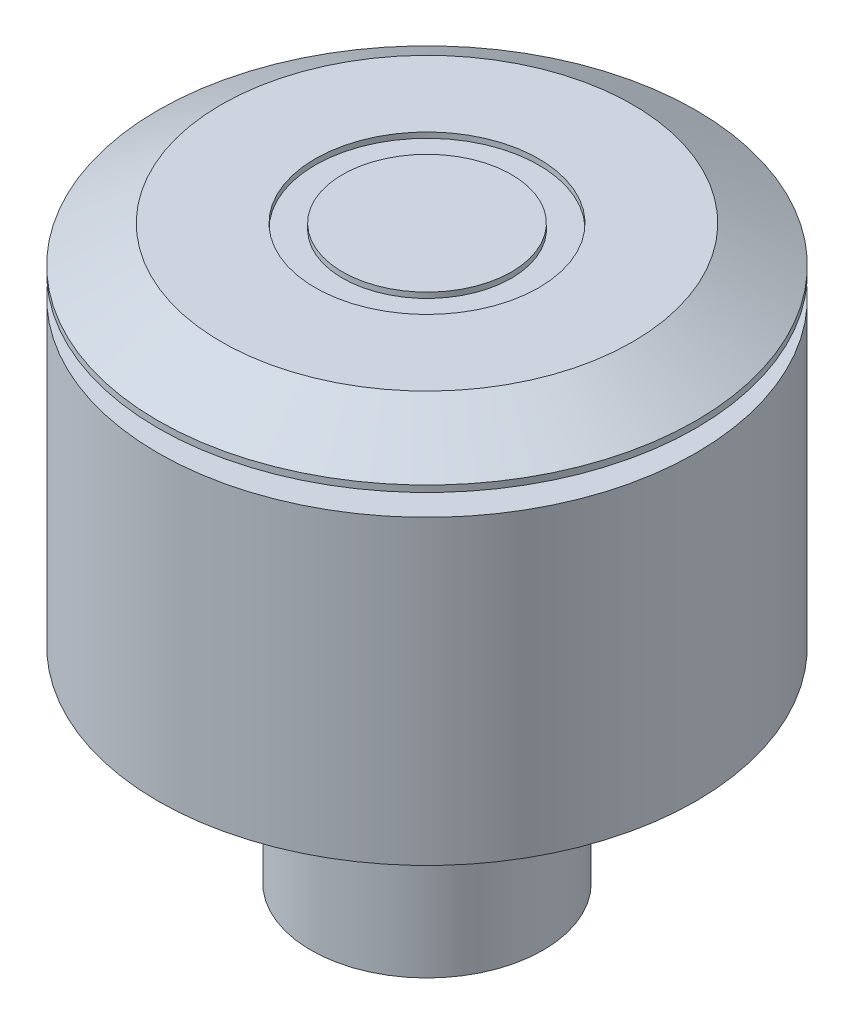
from build123d import *


with BuildPart() as part:
    # Sketch1 → Revolve1 (revolve)
    with BuildSketch(Plane.XY):
        Polygon((0, 0), (5.3975, 0), (5.3975, 9.5504), (12.5, 9.5504), (12.5, 23.5618), (11, 23.5618), (11, 24.5618), (12.5, 24.5618), (12.5, 24.8618), (9.555513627, 26.5618), (5.1943, 26.5618), (5.1943, 26.3078), (3.9243, 26.3078), (3.9243, 26.5618), (0, 26.5618), align=None)
    revolve(axis=Axis((0, -1000, 0), (0, 1, 0)))


solid = part.part
